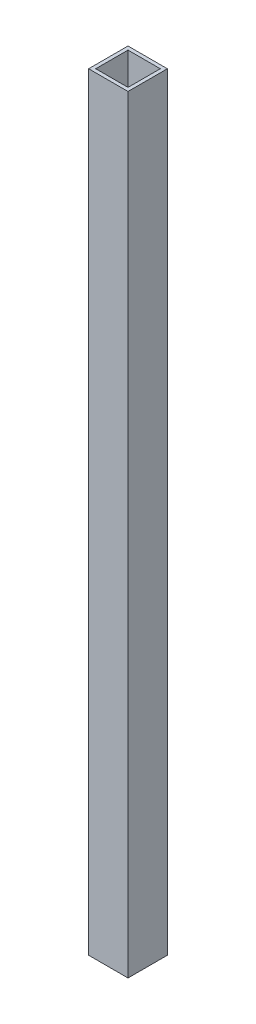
from build123d import *

# Parameters (mm, degrees)
ESQUISSE1_W        = 11.129139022
ESQUISSE1_H        = 11.129139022
ESQUISSE1_W_2      = 9.129139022
ESQUISSE1_H_2      = 9.129139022
BOSS_EXTRU_1_DEPTH = 217


with BuildPart() as part:
    # Esquisse1 → Boss.-Extru.1 (new body)
    with BuildSketch(Plane(origin=(0, 0, 0), x_dir=(1, 0, 0), z_dir=(0, 1, 0))):
        Rectangle(ESQUISSE1_W, ESQUISSE1_H)
        Rectangle(ESQUISSE1_W_2, ESQUISSE1_H_2, mode=Mode.SUBTRACT)
    extrude(amount=BOSS_EXTRU_1_DEPTH)


solid = part.part
